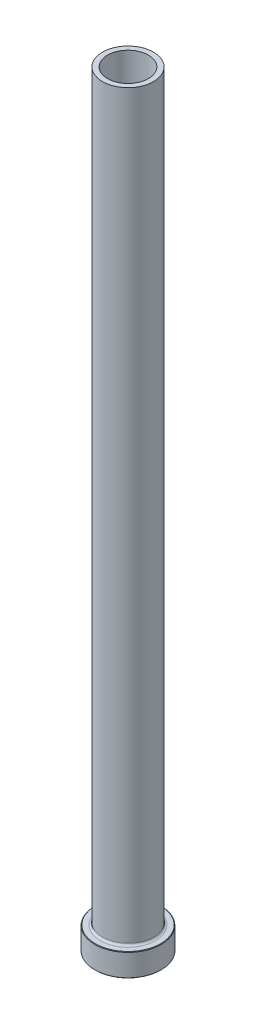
from build123d import *

# Parameters (mm, degrees)
FILLET1_R     = 0.8
CHAMFER1_SIZE = 0.2
CHAMFER3_SIZE = 0.5


with BuildPart() as part:
    # Sketch1 → Revolve1 (revolve)
    with BuildSketch(Plane.XY, mode=Mode.PRIVATE) as revolve1_sk:
        Polygon((-8, 300), (-10, 300), (-10, 9), (-13, 9), (-13, 0), (-8.25, 0), (-8.25, 233), (-8, 245), align=None)
    revolve(revolve1_sk.sketch.rotate(Axis((0, 92.187680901, 0), (0, -1, 0)), 270), axis=Axis((0, 92.187680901, 0), (0, -1, 0)))

    # Fillet1
    fillet1_edges = [part.edges().sort_by_distance(p)[0] for p in [
        (0, 9, -10),
    ]]
    fillet(fillet1_edges, radius=FILLET1_R)

    # Chamfer1
    chamfer1_edges = [part.edges().sort_by_distance(p)[0] for p in [
        (0, 0, -13),
        (0, 9, -13),
    ]]
    chamfer(chamfer1_edges, length=CHAMFER1_SIZE)

    # Chamfer3
    chamfer3_edges = [part.edges().sort_by_distance(p)[0] for p in [
        (0, 0, -8.25),
    ]]
    chamfer(chamfer3_edges, length=CHAMFER3_SIZE)


solid = part.part
